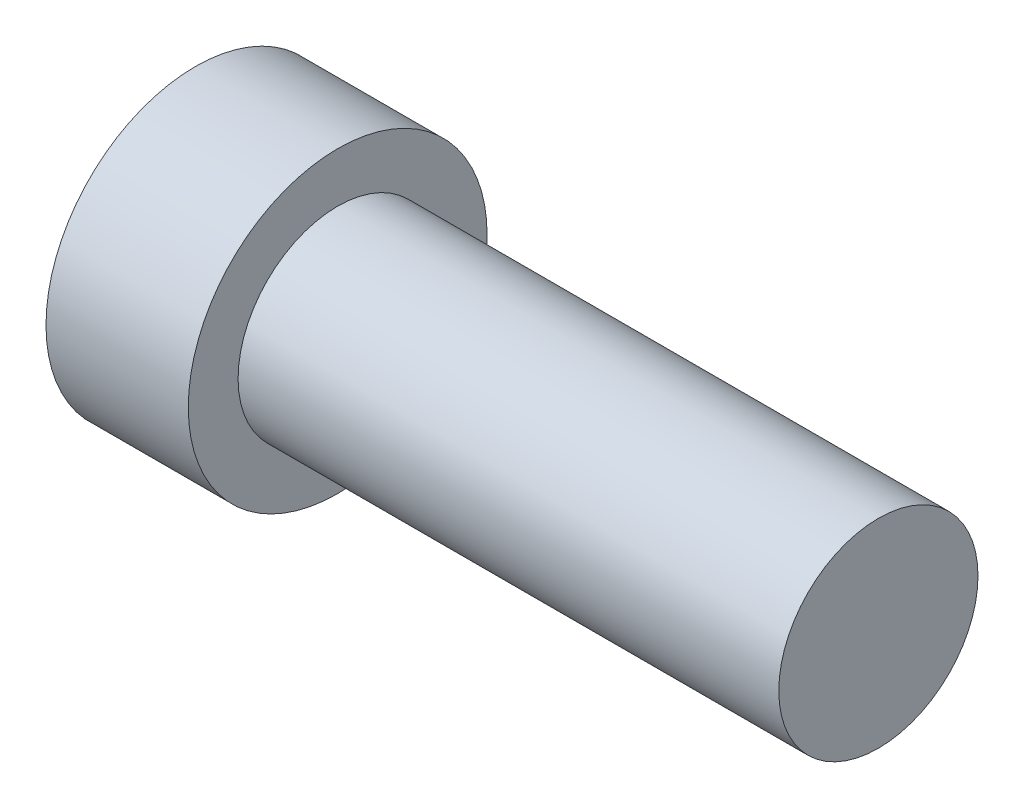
ISO-10303-21;
HEADER;
FILE_DESCRIPTION(('STEP AP214'),'2;1');
FILE_NAME('part.step','',(''),(''),'','','');
FILE_SCHEMA(('AUTOMOTIVE_DESIGN { 1 0 10303 214 1 1 1 1 }'));
ENDSEC;
DATA;
#1=APPLICATION_CONTEXT('core data for automotive mechanical design processes');
#2=APPLICATION_PROTOCOL_DEFINITION('international standard','automotive_design',2000,#1);
#3=PRODUCT_CONTEXT('',#1,'mechanical');
#4=PRODUCT('Part','Part','',(#3));
#5=PRODUCT_RELATED_PRODUCT_CATEGORY('part','',(#4));
#6=PRODUCT_DEFINITION_FORMATION('','',#4);
#7=PRODUCT_DEFINITION_CONTEXT('part definition',#1,'design');
#8=PRODUCT_DEFINITION('design','',#6,#7);
#9=PRODUCT_DEFINITION_SHAPE('','',#8);
#10=(LENGTH_UNIT() NAMED_UNIT(*) SI_UNIT(.MILLI.,.METRE.));
#11=(NAMED_UNIT(*) PLANE_ANGLE_UNIT() SI_UNIT($,.RADIAN.));
#12=(NAMED_UNIT(*) SI_UNIT($,.STERADIAN.) SOLID_ANGLE_UNIT());
#13=UNCERTAINTY_MEASURE_WITH_UNIT(LENGTH_MEASURE(1.E-05),#10,'distance_accuracy_value','');
#14=(GEOMETRIC_REPRESENTATION_CONTEXT(3) GLOBAL_UNCERTAINTY_ASSIGNED_CONTEXT((#13)) GLOBAL_UNIT_ASSIGNED_CONTEXT((#10,
#11,#12)) REPRESENTATION_CONTEXT('',''));
#15=CARTESIAN_POINT('',(0.,0.,0.));
#16=DIRECTION('',(0.,0.,1.));
#17=DIRECTION('',(1.,0.,0.));
#18=AXIS2_PLACEMENT_3D('',#15,#16,#17);
#19=CARTESIAN_POINT('',(0.,0.,0.));
#20=DIRECTION('',(1.,0.,0.));
#21=DIRECTION('',(0.,0.,-1.));
#22=AXIS2_PLACEMENT_3D('',#19,#20,#21);
#23=PLANE('',#22);
#24=CARTESIAN_POINT('',(0.,0.,0.));
#25=DIRECTION('',(-1.,0.,0.));
#26=DIRECTION('',(0.,0.,1.));
#27=AXIS2_PLACEMENT_3D('',#24,#25,#26);
#28=CIRCLE('',#27,0.15);
#29=CARTESIAN_POINT('',(0.,0.,0.15));
#30=VERTEX_POINT('',#29);
#31=EDGE_CURVE('E36',#30,#30,#28,.T.);
#32=ORIENTED_EDGE('',*,*,#31,.F.);
#33=EDGE_LOOP('',(#32));
#34=FACE_BOUND('',#33,.T.);
#35=CARTESIAN_POINT('',(0.,0.,0.));
#36=DIRECTION('',(-1.,0.,0.));
#37=DIRECTION('',(0.,0.,1.));
#38=AXIS2_PLACEMENT_3D('',#35,#36,#37);
#39=CIRCLE('',#38,1.05);
#40=CARTESIAN_POINT('',(0.,0.,1.05));
#41=VERTEX_POINT('',#40);
#42=EDGE_CURVE('E9',#41,#41,#39,.T.);
#43=ORIENTED_EDGE('',*,*,#42,.T.);
#44=EDGE_LOOP('',(#43));
#45=FACE_BOUND('',#44,.T.);
#46=ADVANCED_FACE('F14',(#34,#45),#23,.F.);
#47=CARTESIAN_POINT('',(0.,0.,0.));
#48=DIRECTION('',(-1.,0.,0.));
#49=DIRECTION('',(0.,0.,1.));
#50=AXIS2_PLACEMENT_3D('',#47,#48,#49);
#51=CYLINDRICAL_SURFACE('',#50,1.05);
#52=ORIENTED_EDGE('',*,*,#42,.F.);
#53=EDGE_LOOP('',(#52));
#54=FACE_BOUND('',#53,.T.);
#55=CARTESIAN_POINT('',(1.,0.,0.));
#56=DIRECTION('',(-1.,0.,0.));
#57=DIRECTION('',(0.,0.,1.));
#58=AXIS2_PLACEMENT_3D('',#55,#56,#57);
#59=CIRCLE('',#58,1.05);
#60=CARTESIAN_POINT('',(1.,0.,1.05));
#61=VERTEX_POINT('',#60);
#62=EDGE_CURVE('E20',#61,#61,#59,.T.);
#63=ORIENTED_EDGE('',*,*,#62,.T.);
#64=EDGE_LOOP('',(#63));
#65=FACE_BOUND('',#64,.T.);
#66=ADVANCED_FACE('F43',(#54,#65),#51,.T.);
#67=CARTESIAN_POINT('',(1.,1.05,0.));
#68=DIRECTION('',(-1.,0.,0.));
#69=DIRECTION('',(0.,0.,1.));
#70=AXIS2_PLACEMENT_3D('',#67,#68,#69);
#71=PLANE('',#70);
#72=ORIENTED_EDGE('',*,*,#62,.F.);
#73=EDGE_LOOP('',(#72));
#74=FACE_BOUND('',#73,.T.);
#75=CARTESIAN_POINT('',(1.,0.,0.));
#76=DIRECTION('',(-1.,0.,0.));
#77=DIRECTION('',(0.,0.,1.));
#78=AXIS2_PLACEMENT_3D('',#75,#76,#77);
#79=CIRCLE('',#78,0.7);
#80=CARTESIAN_POINT('',(1.,0.,0.7));
#81=VERTEX_POINT('',#80);
#82=EDGE_CURVE('E24',#81,#81,#79,.T.);
#83=ORIENTED_EDGE('',*,*,#82,.T.);
#84=EDGE_LOOP('',(#83));
#85=FACE_BOUND('',#84,.T.);
#86=ADVANCED_FACE('F49',(#74,#85),#71,.F.);
#87=CARTESIAN_POINT('',(0.,0.,0.));
#88=DIRECTION('',(-1.,0.,0.));
#89=DIRECTION('',(0.,0.,1.));
#90=AXIS2_PLACEMENT_3D('',#87,#88,#89);
#91=CYLINDRICAL_SURFACE('',#90,0.7);
#92=ORIENTED_EDGE('',*,*,#82,.F.);
#93=EDGE_LOOP('',(#92));
#94=FACE_BOUND('',#93,.T.);
#95=CARTESIAN_POINT('',(4.8,0.,0.));
#96=DIRECTION('',(-1.,0.,0.));
#97=DIRECTION('',(0.,0.,1.));
#98=AXIS2_PLACEMENT_3D('',#95,#96,#97);
#99=CIRCLE('',#98,0.7);
#100=CARTESIAN_POINT('',(4.8,0.,0.7));
#101=VERTEX_POINT('',#100);
#102=EDGE_CURVE('E28',#101,#101,#99,.T.);
#103=ORIENTED_EDGE('',*,*,#102,.T.);
#104=EDGE_LOOP('',(#103));
#105=FACE_BOUND('',#104,.T.);
#106=ADVANCED_FACE('F55',(#94,#105),#91,.T.);
#107=CARTESIAN_POINT('',(4.8,0.7,0.));
#108=DIRECTION('',(-1.,0.,0.));
#109=DIRECTION('',(0.,0.,1.));
#110=AXIS2_PLACEMENT_3D('',#107,#108,#109);
#111=PLANE('',#110);
#112=ORIENTED_EDGE('',*,*,#102,.F.);
#113=EDGE_LOOP('',(#112));
#114=FACE_BOUND('',#113,.T.);
#115=ADVANCED_FACE('F61',(#114),#111,.F.);
#116=CARTESIAN_POINT('',(0.,0.,0.));
#117=DIRECTION('',(-1.,0.,0.));
#118=DIRECTION('',(0.,0.,1.));
#119=AXIS2_PLACEMENT_3D('',#116,#117,#118);
#120=CONICAL_SURFACE('',#119,0.15,0.26179938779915);
#121=CARTESIAN_POINT('',(0.3,0.,0.));
#122=DIRECTION('',(-1.,0.,0.));
#123=DIRECTION('',(0.,0.,1.));
#124=AXIS2_PLACEMENT_3D('',#121,#122,#123);
#125=CIRCLE('',#124,0.069615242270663);
#126=CARTESIAN_POINT('',(0.3,0.,0.069615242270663));
#127=VERTEX_POINT('',#126);
#128=EDGE_CURVE('E33',#127,#127,#125,.T.);
#129=ORIENTED_EDGE('',*,*,#128,.F.);
#130=EDGE_LOOP('',(#129));
#131=FACE_BOUND('',#130,.T.);
#132=ORIENTED_EDGE('',*,*,#31,.T.);
#133=EDGE_LOOP('',(#132));
#134=FACE_BOUND('',#133,.T.);
#135=ADVANCED_FACE('F40',(#131,#134),#120,.F.);
#136=CARTESIAN_POINT('',(0.3,0.,0.));
#137=DIRECTION('',(-1.,0.,0.));
#138=DIRECTION('',(0.,0.,1.));
#139=AXIS2_PLACEMENT_3D('',#136,#137,#138);
#140=PLANE('',#139);
#141=ORIENTED_EDGE('',*,*,#128,.T.);
#142=EDGE_LOOP('',(#141));
#143=FACE_BOUND('',#142,.T.);
#144=ADVANCED_FACE('F68',(#143),#140,.T.);
#145=CLOSED_SHELL('',(#46,#66,#86,#106,#115,#135,#144));
#146=MANIFOLD_SOLID_BREP('B1',#145);
#147=ADVANCED_BREP_SHAPE_REPRESENTATION('',(#18,#146),#14);
#148=SHAPE_DEFINITION_REPRESENTATION(#9,#147);
ENDSEC;
END-ISO-10303-21;
